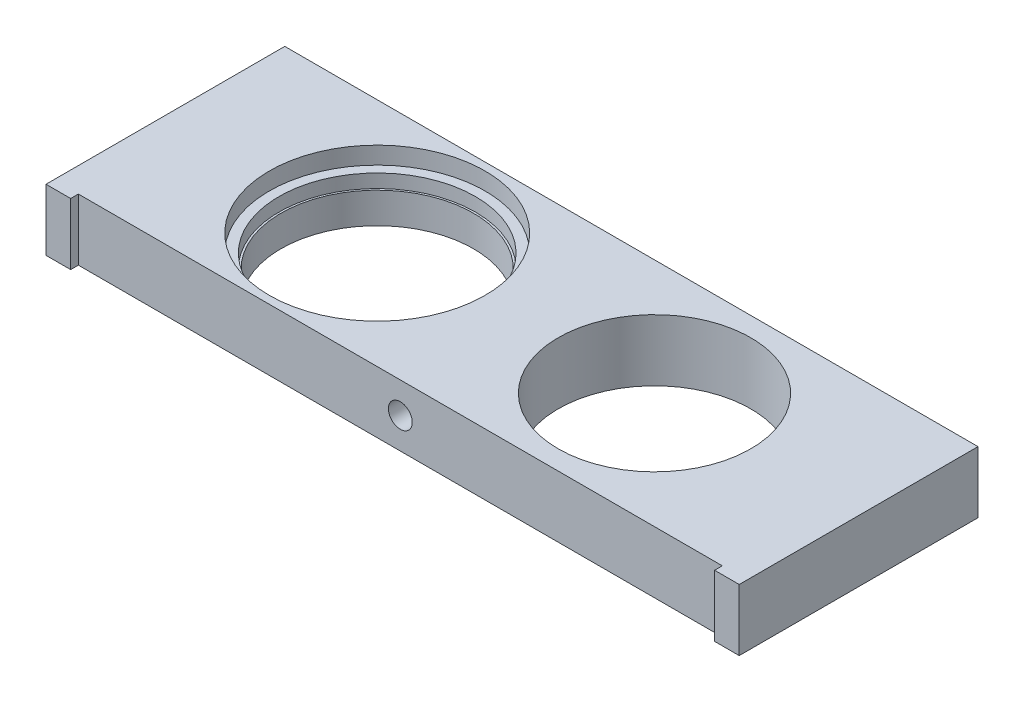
ISO-10303-21;
HEADER;
FILE_DESCRIPTION(('STEP AP214'),'2;1');
FILE_NAME('part.step','',(''),(''),'','','');
FILE_SCHEMA(('AUTOMOTIVE_DESIGN { 1 0 10303 214 1 1 1 1 }'));
ENDSEC;
DATA;
#1=APPLICATION_CONTEXT('core data for automotive mechanical design processes');
#2=APPLICATION_PROTOCOL_DEFINITION('international standard','automotive_design',2000,#1);
#3=PRODUCT_CONTEXT('',#1,'mechanical');
#4=PRODUCT('Part','Part','',(#3));
#5=PRODUCT_RELATED_PRODUCT_CATEGORY('part','',(#4));
#6=PRODUCT_DEFINITION_FORMATION('','',#4);
#7=PRODUCT_DEFINITION_CONTEXT('part definition',#1,'design');
#8=PRODUCT_DEFINITION('design','',#6,#7);
#9=PRODUCT_DEFINITION_SHAPE('','',#8);
#10=(LENGTH_UNIT() NAMED_UNIT(*) SI_UNIT(.MILLI.,.METRE.));
#11=(NAMED_UNIT(*) PLANE_ANGLE_UNIT() SI_UNIT($,.RADIAN.));
#12=(NAMED_UNIT(*) SI_UNIT($,.STERADIAN.) SOLID_ANGLE_UNIT());
#13=UNCERTAINTY_MEASURE_WITH_UNIT(LENGTH_MEASURE(1.E-05),#10,'distance_accuracy_value','');
#14=(GEOMETRIC_REPRESENTATION_CONTEXT(3) GLOBAL_UNCERTAINTY_ASSIGNED_CONTEXT((#13)) GLOBAL_UNIT_ASSIGNED_CONTEXT((#10,
#11,#12)) REPRESENTATION_CONTEXT('',''));
#15=CARTESIAN_POINT('',(0.,0.,0.));
#16=DIRECTION('',(0.,0.,1.));
#17=DIRECTION('',(1.,0.,0.));
#18=AXIS2_PLACEMENT_3D('',#15,#16,#17);
#19=CARTESIAN_POINT('',(45.,-4.,15.));
#20=DIRECTION('',(0.,0.,-1.));
#21=DIRECTION('',(-1.,0.,0.));
#22=AXIS2_PLACEMENT_3D('',#19,#20,#21);
#23=PLANE('',#22);
#24=CARTESIAN_POINT('',(0.,0.,15.));
#25=DIRECTION('',(0.,0.,1.));
#26=DIRECTION('',(1.,0.,0.));
#27=AXIS2_PLACEMENT_3D('',#24,#25,#26);
#28=CIRCLE('',#27,1.55);
#29=CARTESIAN_POINT('',(1.55,0.,15.));
#30=VERTEX_POINT('',#29);
#31=EDGE_CURVE('E419',#30,#30,#28,.T.);
#32=ORIENTED_EDGE('',*,*,#31,.F.);
#33=EDGE_LOOP('',(#32));
#34=FACE_BOUND('',#33,.T.);
#35=DIRECTION('',(0.,-1.,0.));
#36=VECTOR('',#35,1.);
#37=CARTESIAN_POINT('',(41.8,-4.,15.));
#38=LINE('',#37,#36);
#39=CARTESIAN_POINT('',(41.8,4.,15.));
#40=VERTEX_POINT('',#39);
#41=CARTESIAN_POINT('',(41.8,-4.,15.));
#42=VERTEX_POINT('',#41);
#43=EDGE_CURVE('E178',#40,#42,#38,.T.);
#44=ORIENTED_EDGE('',*,*,#43,.F.);
#45=DIRECTION('',(-1.,0.,0.));
#46=VECTOR('',#45,1.);
#47=CARTESIAN_POINT('',(45.,4.,15.));
#48=LINE('',#47,#46);
#49=CARTESIAN_POINT('',(-41.8,4.,15.));
#50=VERTEX_POINT('',#49);
#51=EDGE_CURVE('E38',#40,#50,#48,.T.);
#52=ORIENTED_EDGE('',*,*,#51,.T.);
#53=DIRECTION('',(0.,1.,0.));
#54=VECTOR('',#53,1.);
#55=CARTESIAN_POINT('',(-41.8,-4.,15.));
#56=LINE('',#55,#54);
#57=CARTESIAN_POINT('',(-41.7999999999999,-4.,15.));
#58=VERTEX_POINT('',#57);
#59=EDGE_CURVE('E119',#58,#50,#56,.T.);
#60=ORIENTED_EDGE('',*,*,#59,.F.);
#61=DIRECTION('',(-1.,0.,0.));
#62=VECTOR('',#61,1.);
#63=CARTESIAN_POINT('',(45.,-4.,15.));
#64=LINE('',#63,#62);
#65=EDGE_CURVE('E51',#42,#58,#64,.T.);
#66=ORIENTED_EDGE('',*,*,#65,.F.);
#67=EDGE_LOOP('',(#44,#52,#60,#66));
#68=FACE_BOUND('',#67,.T.);
#69=ADVANCED_FACE('F34',(#34,#68),#23,.F.);
#70=CARTESIAN_POINT('',(-18.,0.,0.));
#71=DIRECTION('',(0.,1.,0.));
#72=DIRECTION('',(0.,0.,1.));
#73=AXIS2_PLACEMENT_3D('',#70,#71,#72);
#74=CYLINDRICAL_SURFACE('',#73,12.75);
#75=CARTESIAN_POINT('',(-18.,0.,0.));
#76=DIRECTION('',(0.,1.,0.));
#77=DIRECTION('',(0.,0.,1.));
#78=AXIS2_PLACEMENT_3D('',#75,#76,#77);
#79=CIRCLE('',#78,12.75);
#80=CARTESIAN_POINT('',(-18.,0.,12.75));
#81=VERTEX_POINT('',#80);
#82=EDGE_CURVE('E142',#81,#81,#79,.T.);
#83=ORIENTED_EDGE('',*,*,#82,.F.);
#84=EDGE_LOOP('',(#83));
#85=FACE_BOUND('',#84,.T.);
#86=CARTESIAN_POINT('',(-18.,1.75,0.));
#87=DIRECTION('',(0.,1.,0.));
#88=DIRECTION('',(0.,0.,1.));
#89=AXIS2_PLACEMENT_3D('',#86,#87,#88);
#90=CIRCLE('',#89,12.75);
#91=CARTESIAN_POINT('',(-18.,1.75,12.75));
#92=VERTEX_POINT('',#91);
#93=EDGE_CURVE('E125',#92,#92,#90,.F.);
#94=ORIENTED_EDGE('',*,*,#93,.F.);
#95=EDGE_LOOP('',(#94));
#96=FACE_BOUND('',#95,.T.);
#97=ADVANCED_FACE('F239',(#85,#96),#74,.F.);
#98=CARTESIAN_POINT('',(-18.,-4.,0.));
#99=DIRECTION('',(0.,1.,0.));
#100=DIRECTION('',(0.,0.,1.));
#101=AXIS2_PLACEMENT_3D('',#98,#99,#100);
#102=CYLINDRICAL_SURFACE('',#101,12.5);
#103=CARTESIAN_POINT('',(-18.,-4.,0.));
#104=DIRECTION('',(0.,1.,0.));
#105=DIRECTION('',(0.,0.,1.));
#106=AXIS2_PLACEMENT_3D('',#103,#104,#105);
#107=CIRCLE('',#106,12.5);
#108=CARTESIAN_POINT('',(-18.,-4.,12.5));
#109=VERTEX_POINT('',#108);
#110=EDGE_CURVE('E95',#109,#109,#107,.T.);
#111=ORIENTED_EDGE('',*,*,#110,.F.);
#112=EDGE_LOOP('',(#111));
#113=FACE_BOUND('',#112,.T.);
#114=CARTESIAN_POINT('',(-18.,0.,0.));
#115=DIRECTION('',(0.,1.,0.));
#116=DIRECTION('',(0.,0.,1.));
#117=AXIS2_PLACEMENT_3D('',#114,#115,#116);
#118=CIRCLE('',#117,12.5);
#119=CARTESIAN_POINT('',(-18.,0.,12.5));
#120=VERTEX_POINT('',#119);
#121=EDGE_CURVE('E145',#120,#120,#118,.F.);
#122=ORIENTED_EDGE('',*,*,#121,.F.);
#123=EDGE_LOOP('',(#122));
#124=FACE_BOUND('',#123,.T.);
#125=ADVANCED_FACE('F245',(#113,#124),#102,.F.);
#126=CARTESIAN_POINT('',(45.,-4.,-15.));
#127=DIRECTION('',(0.,0.,1.));
#128=DIRECTION('',(1.,0.,0.));
#129=AXIS2_PLACEMENT_3D('',#126,#127,#128);
#130=PLANE('',#129);
#131=DIRECTION('',(0.,1.,0.));
#132=VECTOR('',#131,1.);
#133=CARTESIAN_POINT('',(-45.,-4.,-15.));
#134=LINE('',#133,#132);
#135=CARTESIAN_POINT('',(-45.,-4.,-15.));
#136=VERTEX_POINT('',#135);
#137=CARTESIAN_POINT('',(-45.,4.,-15.));
#138=VERTEX_POINT('',#137);
#139=EDGE_CURVE('E91',#136,#138,#134,.T.);
#140=ORIENTED_EDGE('',*,*,#139,.T.);
#141=DIRECTION('',(-1.,0.,0.));
#142=VECTOR('',#141,1.);
#143=CARTESIAN_POINT('',(45.,4.,-15.));
#144=LINE('',#143,#142);
#145=CARTESIAN_POINT('',(45.,4.,-15.));
#146=VERTEX_POINT('',#145);
#147=EDGE_CURVE('E11',#146,#138,#144,.T.);
#148=ORIENTED_EDGE('',*,*,#147,.F.);
#149=DIRECTION('',(0.,1.,0.));
#150=VECTOR('',#149,1.);
#151=CARTESIAN_POINT('',(45.,-4.,-15.));
#152=LINE('',#151,#150);
#153=CARTESIAN_POINT('',(45.,-4.,-15.));
#154=VERTEX_POINT('',#153);
#155=EDGE_CURVE('E85',#154,#146,#152,.T.);
#156=ORIENTED_EDGE('',*,*,#155,.F.);
#157=DIRECTION('',(-1.,0.,0.));
#158=VECTOR('',#157,1.);
#159=CARTESIAN_POINT('',(45.,-4.,-15.));
#160=LINE('',#159,#158);
#161=EDGE_CURVE('E76',#154,#136,#160,.T.);
#162=ORIENTED_EDGE('',*,*,#161,.T.);
#163=EDGE_LOOP('',(#140,#148,#156,#162));
#164=FACE_BOUND('',#163,.T.);
#165=ADVANCED_FACE('F36',(#164),#130,.F.);
#166=CARTESIAN_POINT('',(45.,4.,15.));
#167=DIRECTION('',(0.,-1.,0.));
#168=DIRECTION('',(0.,0.,-1.));
#169=AXIS2_PLACEMENT_3D('',#166,#167,#168);
#170=PLANE('',#169);
#171=CARTESIAN_POINT('',(-18.,4.,0.));
#172=DIRECTION('',(0.,1.,0.));
#173=DIRECTION('',(0.,0.,1.));
#174=AXIS2_PLACEMENT_3D('',#171,#172,#173);
#175=CIRCLE('',#174,14.);
#176=CARTESIAN_POINT('',(-18.,4.,14.));
#177=VERTEX_POINT('',#176);
#178=EDGE_CURVE('E136',#177,#177,#175,.T.);
#179=ORIENTED_EDGE('',*,*,#178,.F.);
#180=EDGE_LOOP('',(#179));
#181=FACE_BOUND('',#180,.T.);
#182=CARTESIAN_POINT('',(18.,4.,0.));
#183=DIRECTION('',(0.,1.,0.));
#184=DIRECTION('',(0.,0.,1.));
#185=AXIS2_PLACEMENT_3D('',#182,#183,#184);
#186=CIRCLE('',#185,12.5);
#187=CARTESIAN_POINT('',(18.,4.,12.5));
#188=VERTEX_POINT('',#187);
#189=EDGE_CURVE('E148',#188,#188,#186,.T.);
#190=ORIENTED_EDGE('',*,*,#189,.F.);
#191=EDGE_LOOP('',(#190));
#192=FACE_BOUND('',#191,.T.);
#193=DIRECTION('',(0.,0.,1.));
#194=VECTOR('',#193,1.);
#195=CARTESIAN_POINT('',(-45.,4.,15.));
#196=LINE('',#195,#194);
#197=CARTESIAN_POINT('',(-45.,4.,16.));
#198=VERTEX_POINT('',#197);
#199=EDGE_CURVE('E86',#138,#198,#196,.T.);
#200=ORIENTED_EDGE('',*,*,#199,.T.);
#201=DIRECTION('',(-1.,0.,0.));
#202=VECTOR('',#201,1.);
#203=CARTESIAN_POINT('',(-45.,4.,16.));
#204=LINE('',#203,#202);
#205=CARTESIAN_POINT('',(-41.8,4.,16.));
#206=VERTEX_POINT('',#205);
#207=EDGE_CURVE('E118',#206,#198,#204,.T.);
#208=ORIENTED_EDGE('',*,*,#207,.F.);
#209=DIRECTION('',(0.,0.,-1.));
#210=VECTOR('',#209,1.);
#211=CARTESIAN_POINT('',(-41.8,4.,16.));
#212=LINE('',#211,#210);
#213=EDGE_CURVE('E113',#206,#50,#212,.T.);
#214=ORIENTED_EDGE('',*,*,#213,.T.);
#215=ORIENTED_EDGE('',*,*,#51,.F.);
#216=DIRECTION('',(0.,0.,-1.));
#217=VECTOR('',#216,1.);
#218=CARTESIAN_POINT('',(41.8,4.,16.));
#219=LINE('',#218,#217);
#220=CARTESIAN_POINT('',(41.8,4.,16.));
#221=VERTEX_POINT('',#220);
#222=EDGE_CURVE('E124',#221,#40,#219,.T.);
#223=ORIENTED_EDGE('',*,*,#222,.F.);
#224=DIRECTION('',(-1.,0.,0.));
#225=VECTOR('',#224,1.);
#226=CARTESIAN_POINT('',(45.,4.,16.));
#227=LINE('',#226,#225);
#228=CARTESIAN_POINT('',(45.,4.,16.));
#229=VERTEX_POINT('',#228);
#230=EDGE_CURVE('E165',#229,#221,#227,.T.);
#231=ORIENTED_EDGE('',*,*,#230,.F.);
#232=DIRECTION('',(0.,0.,1.));
#233=VECTOR('',#232,1.);
#234=CARTESIAN_POINT('',(45.,4.,15.));
#235=LINE('',#234,#233);
#236=EDGE_CURVE('E151',#146,#229,#235,.T.);
#237=ORIENTED_EDGE('',*,*,#236,.F.);
#238=ORIENTED_EDGE('',*,*,#147,.T.);
#239=EDGE_LOOP('',(#200,#208,#214,#215,#223,#231,#237,#238));
#240=FACE_BOUND('',#239,.T.);
#241=ADVANCED_FACE('F166',(#181,#192,#240),#170,.F.);
#242=CARTESIAN_POINT('',(45.,-4.,15.));
#243=DIRECTION('',(0.,1.,0.));
#244=DIRECTION('',(0.,0.,1.));
#245=AXIS2_PLACEMENT_3D('',#242,#243,#244);
#246=PLANE('',#245);
#247=CARTESIAN_POINT('',(18.,-4.,0.));
#248=DIRECTION('',(0.,1.,0.));
#249=DIRECTION('',(0.,0.,1.));
#250=AXIS2_PLACEMENT_3D('',#247,#248,#249);
#251=CIRCLE('',#250,12.5);
#252=CARTESIAN_POINT('',(18.,-4.,12.5));
#253=VERTEX_POINT('',#252);
#254=EDGE_CURVE('E99',#253,#253,#251,.T.);
#255=ORIENTED_EDGE('',*,*,#254,.T.);
#256=EDGE_LOOP('',(#255));
#257=FACE_BOUND('',#256,.T.);
#258=ORIENTED_EDGE('',*,*,#110,.T.);
#259=EDGE_LOOP('',(#258));
#260=FACE_BOUND('',#259,.T.);
#261=DIRECTION('',(0.,0.,-1.));
#262=VECTOR('',#261,1.);
#263=CARTESIAN_POINT('',(-45.,-4.,15.));
#264=LINE('',#263,#262);
#265=CARTESIAN_POINT('',(-45.,-4.,16.));
#266=VERTEX_POINT('',#265);
#267=EDGE_CURVE('E73',#266,#136,#264,.T.);
#268=ORIENTED_EDGE('',*,*,#267,.T.);
#269=ORIENTED_EDGE('',*,*,#161,.F.);
#270=DIRECTION('',(0.,0.,-1.));
#271=VECTOR('',#270,1.);
#272=CARTESIAN_POINT('',(45.,-4.,15.));
#273=LINE('',#272,#271);
#274=CARTESIAN_POINT('',(45.,-4.,16.));
#275=VERTEX_POINT('',#274);
#276=EDGE_CURVE('E60',#275,#154,#273,.T.);
#277=ORIENTED_EDGE('',*,*,#276,.F.);
#278=DIRECTION('',(1.,0.,0.));
#279=VECTOR('',#278,1.);
#280=CARTESIAN_POINT('',(45.,-4.,16.));
#281=LINE('',#280,#279);
#282=CARTESIAN_POINT('',(41.8,-4.,16.));
#283=VERTEX_POINT('',#282);
#284=EDGE_CURVE('E177',#283,#275,#281,.T.);
#285=ORIENTED_EDGE('',*,*,#284,.F.);
#286=DIRECTION('',(0.,0.,-1.));
#287=VECTOR('',#286,1.);
#288=CARTESIAN_POINT('',(41.8,-4.,16.));
#289=LINE('',#288,#287);
#290=EDGE_CURVE('E187',#283,#42,#289,.T.);
#291=ORIENTED_EDGE('',*,*,#290,.T.);
#292=ORIENTED_EDGE('',*,*,#65,.T.);
#293=DIRECTION('',(0.,0.,-1.));
#294=VECTOR('',#293,1.);
#295=CARTESIAN_POINT('',(-41.8,-4.,16.));
#296=LINE('',#295,#294);
#297=CARTESIAN_POINT('',(-41.8,-4.,16.));
#298=VERTEX_POINT('',#297);
#299=EDGE_CURVE('E109',#298,#58,#296,.T.);
#300=ORIENTED_EDGE('',*,*,#299,.F.);
#301=DIRECTION('',(1.,0.,0.));
#302=VECTOR('',#301,1.);
#303=CARTESIAN_POINT('',(-45.,-4.,16.));
#304=LINE('',#303,#302);
#305=EDGE_CURVE('E80',#266,#298,#304,.T.);
#306=ORIENTED_EDGE('',*,*,#305,.F.);
#307=EDGE_LOOP('',(#268,#269,#277,#285,#291,#292,#300,#306));
#308=FACE_BOUND('',#307,.T.);
#309=ADVANCED_FACE('F75',(#257,#260,#308),#246,.F.);
#310=CARTESIAN_POINT('',(45.,0.,0.));
#311=DIRECTION('',(-1.,0.,0.));
#312=DIRECTION('',(0.,0.,1.));
#313=AXIS2_PLACEMENT_3D('',#310,#311,#312);
#314=PLANE('',#313);
#315=ORIENTED_EDGE('',*,*,#155,.T.);
#316=ORIENTED_EDGE('',*,*,#236,.T.);
#317=DIRECTION('',(0.,1.,0.));
#318=VECTOR('',#317,1.);
#319=CARTESIAN_POINT('',(45.,-4.,16.));
#320=LINE('',#319,#318);
#321=EDGE_CURVE('E158',#275,#229,#320,.T.);
#322=ORIENTED_EDGE('',*,*,#321,.F.);
#323=ORIENTED_EDGE('',*,*,#276,.T.);
#324=EDGE_LOOP('',(#315,#316,#322,#323));
#325=FACE_BOUND('',#324,.T.);
#326=ADVANCED_FACE('F155',(#325),#314,.F.);
#327=CARTESIAN_POINT('',(-45.,0.,0.));
#328=DIRECTION('',(-1.,0.,0.));
#329=DIRECTION('',(0.,0.,1.));
#330=AXIS2_PLACEMENT_3D('',#327,#328,#329);
#331=PLANE('',#330);
#332=CARTESIAN_POINT('',(-45.,0.,0.));
#333=DIRECTION('',(-1.,0.,0.));
#334=DIRECTION('',(0.,0.,1.));
#335=AXIS2_PLACEMENT_3D('',#332,#333,#334);
#336=CIRCLE('',#335,1.24999999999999);
#337=CARTESIAN_POINT('',(-45.,0.,1.24999999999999));
#338=VERTEX_POINT('',#337);
#339=EDGE_CURVE('E112',#338,#338,#336,.T.);
#340=ORIENTED_EDGE('',*,*,#339,.F.);
#341=EDGE_LOOP('',(#340));
#342=FACE_BOUND('',#341,.T.);
#343=ORIENTED_EDGE('',*,*,#139,.F.);
#344=ORIENTED_EDGE('',*,*,#267,.F.);
#345=DIRECTION('',(0.,-1.,0.));
#346=VECTOR('',#345,1.);
#347=CARTESIAN_POINT('',(-45.,-4.,16.));
#348=LINE('',#347,#346);
#349=EDGE_CURVE('E123',#198,#266,#348,.T.);
#350=ORIENTED_EDGE('',*,*,#349,.F.);
#351=ORIENTED_EDGE('',*,*,#199,.F.);
#352=EDGE_LOOP('',(#343,#344,#350,#351));
#353=FACE_BOUND('',#352,.T.);
#354=ADVANCED_FACE('F93',(#342,#353),#331,.T.);
#355=CARTESIAN_POINT('',(18.,-4.,0.));
#356=DIRECTION('',(0.,1.,0.));
#357=DIRECTION('',(0.,0.,1.));
#358=AXIS2_PLACEMENT_3D('',#355,#356,#357);
#359=CYLINDRICAL_SURFACE('',#358,12.5);
#360=ORIENTED_EDGE('',*,*,#254,.F.);
#361=EDGE_LOOP('',(#360));
#362=FACE_BOUND('',#361,.T.);
#363=ORIENTED_EDGE('',*,*,#189,.T.);
#364=EDGE_LOOP('',(#363));
#365=FACE_BOUND('',#364,.T.);
#366=ADVANCED_FACE('F227',(#362,#365),#359,.F.);
#367=CARTESIAN_POINT('',(-18.,0.,0.));
#368=DIRECTION('',(0.,1.,0.));
#369=DIRECTION('',(0.,0.,1.));
#370=AXIS2_PLACEMENT_3D('',#367,#368,#369);
#371=PLANE('',#370);
#372=ORIENTED_EDGE('',*,*,#82,.T.);
#373=EDGE_LOOP('',(#372));
#374=FACE_BOUND('',#373,.T.);
#375=ORIENTED_EDGE('',*,*,#121,.T.);
#376=EDGE_LOOP('',(#375));
#377=FACE_BOUND('',#376,.T.);
#378=ADVANCED_FACE('F233',(#374,#377),#371,.T.);
#379=CARTESIAN_POINT('',(-18.,1.75,0.));
#380=DIRECTION('',(0.,1.,0.));
#381=DIRECTION('',(0.,0.,1.));
#382=AXIS2_PLACEMENT_3D('',#379,#380,#381);
#383=PLANE('',#382);
#384=CARTESIAN_POINT('',(-18.,1.75,0.));
#385=DIRECTION('',(0.,1.,0.));
#386=DIRECTION('',(0.,0.,1.));
#387=AXIS2_PLACEMENT_3D('',#384,#385,#386);
#388=CIRCLE('',#387,14.);
#389=CARTESIAN_POINT('',(-18.,1.75,14.));
#390=VERTEX_POINT('',#389);
#391=EDGE_CURVE('E137',#390,#390,#388,.T.);
#392=ORIENTED_EDGE('',*,*,#391,.T.);
#393=EDGE_LOOP('',(#392));
#394=FACE_BOUND('',#393,.T.);
#395=ORIENTED_EDGE('',*,*,#93,.T.);
#396=EDGE_LOOP('',(#395));
#397=FACE_BOUND('',#396,.T.);
#398=ADVANCED_FACE('F263',(#394,#397),#383,.T.);
#399=CARTESIAN_POINT('',(-18.,1.75,0.));
#400=DIRECTION('',(0.,1.,0.));
#401=DIRECTION('',(0.,0.,1.));
#402=AXIS2_PLACEMENT_3D('',#399,#400,#401);
#403=CYLINDRICAL_SURFACE('',#402,14.);
#404=ORIENTED_EDGE('',*,*,#391,.F.);
#405=EDGE_LOOP('',(#404));
#406=FACE_BOUND('',#405,.T.);
#407=ORIENTED_EDGE('',*,*,#178,.T.);
#408=EDGE_LOOP('',(#407));
#409=FACE_BOUND('',#408,.T.);
#410=ADVANCED_FACE('F216',(#406,#409),#403,.F.);
#411=CARTESIAN_POINT('',(-38.,0.,0.));
#412=DIRECTION('',(-1.,0.,0.));
#413=DIRECTION('',(0.,0.,1.));
#414=AXIS2_PLACEMENT_3D('',#411,#412,#413);
#415=CONICAL_SURFACE('',#414,1.25,1.02974425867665);
#416=CARTESIAN_POINT('',(-37.2489242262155,0.,0.));
#417=VERTEX_POINT('',#416);
#418=VERTEX_LOOP('',#417);
#419=FACE_BOUND('',#418,.T.);
#420=CARTESIAN_POINT('',(-38.,0.,0.));
#421=DIRECTION('',(-1.,0.,0.));
#422=DIRECTION('',(0.,0.,1.));
#423=AXIS2_PLACEMENT_3D('',#420,#421,#422);
#424=CIRCLE('',#423,1.25);
#425=CARTESIAN_POINT('',(-38.,0.,1.25));
#426=VERTEX_POINT('',#425);
#427=EDGE_CURVE('E133',#426,#426,#424,.T.);
#428=ORIENTED_EDGE('',*,*,#427,.T.);
#429=EDGE_LOOP('',(#428));
#430=FACE_BOUND('',#429,.T.);
#431=ADVANCED_FACE('F212',(#419,#430),#415,.F.);
#432=CARTESIAN_POINT('',(-45.,0.,0.));
#433=DIRECTION('',(-1.,0.,0.));
#434=DIRECTION('',(0.,0.,1.));
#435=AXIS2_PLACEMENT_3D('',#432,#433,#434);
#436=CYLINDRICAL_SURFACE('',#435,1.24999999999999);
#437=ORIENTED_EDGE('',*,*,#427,.F.);
#438=EDGE_LOOP('',(#437));
#439=FACE_BOUND('',#438,.T.);
#440=ORIENTED_EDGE('',*,*,#339,.T.);
#441=EDGE_LOOP('',(#440));
#442=FACE_BOUND('',#441,.T.);
#443=ADVANCED_FACE('F215',(#439,#442),#436,.F.);
#444=CARTESIAN_POINT('',(-41.8,-4.,16.));
#445=DIRECTION('',(-1.,0.,0.));
#446=DIRECTION('',(0.,-1.,0.));
#447=AXIS2_PLACEMENT_3D('',#444,#445,#446);
#448=PLANE('',#447);
#449=ORIENTED_EDGE('',*,*,#59,.T.);
#450=ORIENTED_EDGE('',*,*,#213,.F.);
#451=DIRECTION('',(0.,1.,0.));
#452=VECTOR('',#451,1.);
#453=CARTESIAN_POINT('',(-41.8,-4.,16.));
#454=LINE('',#453,#452);
#455=EDGE_CURVE('E192',#298,#206,#454,.T.);
#456=ORIENTED_EDGE('',*,*,#455,.F.);
#457=ORIENTED_EDGE('',*,*,#299,.T.);
#458=EDGE_LOOP('',(#449,#450,#456,#457));
#459=FACE_BOUND('',#458,.T.);
#460=ADVANCED_FACE('F222',(#459),#448,.F.);
#461=CARTESIAN_POINT('',(0.,0.,16.));
#462=DIRECTION('',(0.,0.,-1.));
#463=DIRECTION('',(-1.,0.,0.));
#464=AXIS2_PLACEMENT_3D('',#461,#462,#463);
#465=PLANE('',#464);
#466=ORIENTED_EDGE('',*,*,#349,.T.);
#467=ORIENTED_EDGE('',*,*,#305,.T.);
#468=ORIENTED_EDGE('',*,*,#455,.T.);
#469=ORIENTED_EDGE('',*,*,#207,.T.);
#470=EDGE_LOOP('',(#466,#467,#468,#469));
#471=FACE_BOUND('',#470,.T.);
#472=ADVANCED_FACE('F201',(#471),#465,.F.);
#473=CARTESIAN_POINT('',(41.8,-4.,16.));
#474=DIRECTION('',(1.,0.,0.));
#475=DIRECTION('',(0.,0.,-1.));
#476=AXIS2_PLACEMENT_3D('',#473,#474,#475);
#477=PLANE('',#476);
#478=ORIENTED_EDGE('',*,*,#43,.T.);
#479=ORIENTED_EDGE('',*,*,#290,.F.);
#480=DIRECTION('',(0.,-1.,0.));
#481=VECTOR('',#480,1.);
#482=CARTESIAN_POINT('',(41.8,-4.,16.));
#483=LINE('',#482,#481);
#484=EDGE_CURVE('E172',#221,#283,#483,.T.);
#485=ORIENTED_EDGE('',*,*,#484,.F.);
#486=ORIENTED_EDGE('',*,*,#222,.T.);
#487=EDGE_LOOP('',(#478,#479,#485,#486));
#488=FACE_BOUND('',#487,.T.);
#489=ADVANCED_FACE('F371',(#488),#477,.F.);
#490=CARTESIAN_POINT('',(0.,0.,16.));
#491=DIRECTION('',(0.,0.,1.));
#492=DIRECTION('',(1.,0.,0.));
#493=AXIS2_PLACEMENT_3D('',#490,#491,#492);
#494=PLANE('',#493);
#495=ORIENTED_EDGE('',*,*,#321,.T.);
#496=ORIENTED_EDGE('',*,*,#230,.T.);
#497=ORIENTED_EDGE('',*,*,#484,.T.);
#498=ORIENTED_EDGE('',*,*,#284,.T.);
#499=EDGE_LOOP('',(#495,#496,#497,#498));
#500=FACE_BOUND('',#499,.T.);
#501=ADVANCED_FACE('F175',(#500),#494,.T.);
#502=CARTESIAN_POINT('',(0.,0.,4.99999999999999));
#503=DIRECTION('',(0.,0.,1.));
#504=DIRECTION('',(1.,0.,0.));
#505=AXIS2_PLACEMENT_3D('',#502,#503,#504);
#506=CONICAL_SURFACE('',#505,1.55,1.02974425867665);
#507=CARTESIAN_POINT('',(0.,0.,4.06866604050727));
#508=VERTEX_POINT('',#507);
#509=VERTEX_LOOP('',#508);
#510=FACE_BOUND('',#509,.T.);
#511=CARTESIAN_POINT('',(0.,0.,4.99999999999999));
#512=DIRECTION('',(0.,0.,1.));
#513=DIRECTION('',(1.,0.,0.));
#514=AXIS2_PLACEMENT_3D('',#511,#512,#513);
#515=CIRCLE('',#514,1.55);
#516=CARTESIAN_POINT('',(1.55,0.,4.99999999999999));
#517=VERTEX_POINT('',#516);
#518=EDGE_CURVE('E181',#517,#517,#515,.T.);
#519=ORIENTED_EDGE('',*,*,#518,.T.);
#520=EDGE_LOOP('',(#519));
#521=FACE_BOUND('',#520,.T.);
#522=ADVANCED_FACE('F388',(#510,#521),#506,.F.);
#523=CARTESIAN_POINT('',(0.,0.,15.));
#524=DIRECTION('',(0.,0.,1.));
#525=DIRECTION('',(1.,0.,0.));
#526=AXIS2_PLACEMENT_3D('',#523,#524,#525);
#527=CYLINDRICAL_SURFACE('',#526,1.55);
#528=ORIENTED_EDGE('',*,*,#518,.F.);
#529=EDGE_LOOP('',(#528));
#530=FACE_BOUND('',#529,.T.);
#531=ORIENTED_EDGE('',*,*,#31,.T.);
#532=EDGE_LOOP('',(#531));
#533=FACE_BOUND('',#532,.T.);
#534=ADVANCED_FACE('F401',(#530,#533),#527,.F.);
#535=CLOSED_SHELL('',(#69,#97,#125,#165,#241,#309,#326,#354,#366,#378,#398,#410,#431,#443,#460,
#472,#489,#501,#522,#534));
#536=MANIFOLD_SOLID_BREP('B2',#535);
#537=ADVANCED_BREP_SHAPE_REPRESENTATION('',(#18,#536),#14);
#538=SHAPE_DEFINITION_REPRESENTATION(#9,#537);
ENDSEC;
END-ISO-10303-21;
